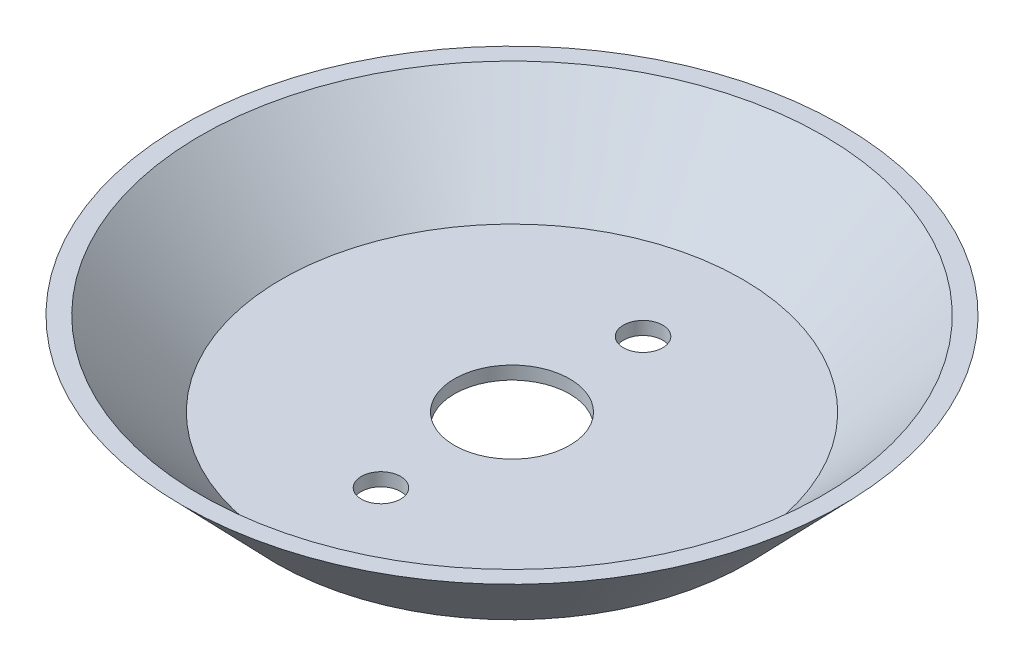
ISO-10303-21;
HEADER;
FILE_DESCRIPTION(('STEP AP214'),'2;1');
FILE_NAME('part.step','',(''),(''),'','','');
FILE_SCHEMA(('AUTOMOTIVE_DESIGN { 1 0 10303 214 1 1 1 1 }'));
ENDSEC;
DATA;
#1=APPLICATION_CONTEXT('core data for automotive mechanical design processes');
#2=APPLICATION_PROTOCOL_DEFINITION('international standard','automotive_design',2000,#1);
#3=PRODUCT_CONTEXT('',#1,'mechanical');
#4=PRODUCT('Part','Part','',(#3));
#5=PRODUCT_RELATED_PRODUCT_CATEGORY('part','',(#4));
#6=PRODUCT_DEFINITION_FORMATION('','',#4);
#7=PRODUCT_DEFINITION_CONTEXT('part definition',#1,'design');
#8=PRODUCT_DEFINITION('design','',#6,#7);
#9=PRODUCT_DEFINITION_SHAPE('','',#8);
#10=(LENGTH_UNIT() NAMED_UNIT(*) SI_UNIT(.MILLI.,.METRE.));
#11=(NAMED_UNIT(*) PLANE_ANGLE_UNIT() SI_UNIT($,.RADIAN.));
#12=(NAMED_UNIT(*) SI_UNIT($,.STERADIAN.) SOLID_ANGLE_UNIT());
#13=UNCERTAINTY_MEASURE_WITH_UNIT(LENGTH_MEASURE(1.E-05),#10,'distance_accuracy_value','');
#14=(GEOMETRIC_REPRESENTATION_CONTEXT(3) GLOBAL_UNCERTAINTY_ASSIGNED_CONTEXT((#13)) GLOBAL_UNIT_ASSIGNED_CONTEXT((#10,
#11,#12)) REPRESENTATION_CONTEXT('',''));
#15=CARTESIAN_POINT('',(0.,0.,0.));
#16=DIRECTION('',(0.,0.,1.));
#17=DIRECTION('',(1.,0.,0.));
#18=AXIS2_PLACEMENT_3D('',#15,#16,#17);
#19=CARTESIAN_POINT('',(-7.95774089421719,7.4,0.));
#20=DIRECTION('',(0.,-1.,0.));
#21=DIRECTION('',(0.,0.,-1.));
#22=AXIS2_PLACEMENT_3D('',#19,#20,#21);
#23=PLANE('',#22);
#24=CARTESIAN_POINT('',(0.,7.4,0.));
#25=DIRECTION('',(0.,1.,0.));
#26=DIRECTION('',(0.,0.,1.));
#27=AXIS2_PLACEMENT_3D('',#24,#25,#26);
#28=CIRCLE('',#27,25.15);
#29=CARTESIAN_POINT('',(0.,7.4,25.15));
#30=VERTEX_POINT('',#29);
#31=EDGE_CURVE('E31',#30,#30,#28,.T.);
#32=ORIENTED_EDGE('',*,*,#31,.T.);
#33=EDGE_LOOP('',(#32));
#34=FACE_BOUND('',#33,.T.);
#35=CARTESIAN_POINT('',(0.,7.4,0.));
#36=DIRECTION('',(0.,-1.,0.));
#37=DIRECTION('',(0.,0.,-1.));
#38=AXIS2_PLACEMENT_3D('',#35,#36,#37);
#39=CIRCLE('',#38,23.7594699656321);
#40=CARTESIAN_POINT('',(0.,7.4,-23.7594699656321));
#41=VERTEX_POINT('',#40);
#42=EDGE_CURVE('E39',#41,#41,#39,.F.);
#43=ORIENTED_EDGE('',*,*,#42,.F.);
#44=EDGE_LOOP('',(#43));
#45=FACE_BOUND('',#44,.T.);
#46=ADVANCED_FACE('F24',(#34,#45),#23,.F.);
#47=CARTESIAN_POINT('',(0.,0.,0.));
#48=DIRECTION('',(0.,1.,0.));
#49=DIRECTION('',(0.,0.,1.));
#50=AXIS2_PLACEMENT_3D('',#47,#48,#49);
#51=CONICAL_SURFACE('',#50,18.,0.768217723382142);
#52=ORIENTED_EDGE('',*,*,#31,.F.);
#53=EDGE_LOOP('',(#52));
#54=FACE_BOUND('',#53,.T.);
#55=CARTESIAN_POINT('',(0.,0.,0.));
#56=DIRECTION('',(0.,1.,0.));
#57=DIRECTION('',(0.,0.,1.));
#58=AXIS2_PLACEMENT_3D('',#55,#56,#57);
#59=CIRCLE('',#58,18.);
#60=CARTESIAN_POINT('',(0.,0.,18.));
#61=VERTEX_POINT('',#60);
#62=EDGE_CURVE('E10',#61,#61,#59,.T.);
#63=ORIENTED_EDGE('',*,*,#62,.T.);
#64=EDGE_LOOP('',(#63));
#65=FACE_BOUND('',#64,.T.);
#66=ADVANCED_FACE('F26',(#54,#65),#51,.T.);
#67=CARTESIAN_POINT('',(-7.95774089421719,0.,0.));
#68=DIRECTION('',(0.,-1.,0.));
#69=DIRECTION('',(0.,0.,-1.));
#70=AXIS2_PLACEMENT_3D('',#67,#68,#69);
#71=PLANE('',#70);
#72=CARTESIAN_POINT('',(0.,0.,10.));
#73=DIRECTION('',(0.,-1.,0.));
#74=DIRECTION('',(0.,0.,-1.));
#75=AXIS2_PLACEMENT_3D('',#72,#73,#74);
#76=CIRCLE('',#75,1.5);
#77=CARTESIAN_POINT('',(0.,0.,8.5));
#78=VERTEX_POINT('',#77);
#79=EDGE_CURVE('E56',#78,#78,#76,.T.);
#80=ORIENTED_EDGE('',*,*,#79,.F.);
#81=EDGE_LOOP('',(#80));
#82=FACE_BOUND('',#81,.T.);
#83=CARTESIAN_POINT('',(0.,0.,-10.));
#84=DIRECTION('',(0.,-1.,0.));
#85=DIRECTION('',(0.,0.,-1.));
#86=AXIS2_PLACEMENT_3D('',#83,#84,#85);
#87=CIRCLE('',#86,1.5);
#88=CARTESIAN_POINT('',(0.,0.,-11.5));
#89=VERTEX_POINT('',#88);
#90=EDGE_CURVE('E50',#89,#89,#87,.T.);
#91=ORIENTED_EDGE('',*,*,#90,.F.);
#92=EDGE_LOOP('',(#91));
#93=FACE_BOUND('',#92,.T.);
#94=CARTESIAN_POINT('',(0.,0.,0.));
#95=DIRECTION('',(0.,-1.,0.));
#96=DIRECTION('',(0.,0.,-1.));
#97=AXIS2_PLACEMENT_3D('',#94,#95,#96);
#98=CIRCLE('',#97,4.4);
#99=CARTESIAN_POINT('',(0.,0.,-4.4));
#100=VERTEX_POINT('',#99);
#101=EDGE_CURVE('E43',#100,#100,#98,.T.);
#102=ORIENTED_EDGE('',*,*,#101,.F.);
#103=EDGE_LOOP('',(#102));
#104=FACE_BOUND('',#103,.T.);
#105=ORIENTED_EDGE('',*,*,#62,.F.);
#106=EDGE_LOOP('',(#105));
#107=FACE_BOUND('',#106,.T.);
#108=ADVANCED_FACE('F78',(#82,#93,#104,#107),#71,.T.);
#109=CARTESIAN_POINT('',(0.,0.694854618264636,0.));
#110=DIRECTION('',(0.,1.,0.));
#111=DIRECTION('',(0.,0.,1.));
#112=AXIS2_PLACEMENT_3D('',#109,#110,#111);
#113=CONICAL_SURFACE('',#112,17.2808497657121,0.768217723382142);
#114=ORIENTED_EDGE('',*,*,#42,.T.);
#115=EDGE_LOOP('',(#114));
#116=FACE_BOUND('',#115,.T.);
#117=CARTESIAN_POINT('',(0.,1.,0.));
#118=DIRECTION('',(0.,-1.,0.));
#119=DIRECTION('',(0.,0.,-1.));
#120=AXIS2_PLACEMENT_3D('',#117,#118,#119);
#121=CIRCLE('',#120,17.5756861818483);
#122=CARTESIAN_POINT('',(0.,1.,-17.5756861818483));
#123=VERTEX_POINT('',#122);
#124=EDGE_CURVE('E35',#123,#123,#121,.F.);
#125=ORIENTED_EDGE('',*,*,#124,.F.);
#126=EDGE_LOOP('',(#125));
#127=FACE_BOUND('',#126,.T.);
#128=ADVANCED_FACE('F69',(#116,#127),#113,.F.);
#129=CARTESIAN_POINT('',(-7.95774089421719,1.,0.));
#130=DIRECTION('',(0.,-1.,0.));
#131=DIRECTION('',(0.,0.,-1.));
#132=AXIS2_PLACEMENT_3D('',#129,#130,#131);
#133=PLANE('',#132);
#134=CARTESIAN_POINT('',(0.,1.,10.));
#135=DIRECTION('',(0.,1.,0.));
#136=DIRECTION('',(0.,0.,-1.));
#137=AXIS2_PLACEMENT_3D('',#134,#135,#136);
#138=CIRCLE('',#137,1.5);
#139=CARTESIAN_POINT('',(0.,1.,8.5));
#140=VERTEX_POINT('',#139);
#141=EDGE_CURVE('E59',#140,#140,#138,.T.);
#142=ORIENTED_EDGE('',*,*,#141,.F.);
#143=EDGE_LOOP('',(#142));
#144=FACE_BOUND('',#143,.T.);
#145=CARTESIAN_POINT('',(0.,1.,-10.));
#146=DIRECTION('',(0.,1.,0.));
#147=DIRECTION('',(0.,0.,1.));
#148=AXIS2_PLACEMENT_3D('',#145,#146,#147);
#149=CIRCLE('',#148,1.5);
#150=CARTESIAN_POINT('',(0.,1.,-8.5));
#151=VERTEX_POINT('',#150);
#152=EDGE_CURVE('E53',#151,#151,#149,.T.);
#153=ORIENTED_EDGE('',*,*,#152,.F.);
#154=EDGE_LOOP('',(#153));
#155=FACE_BOUND('',#154,.T.);
#156=CARTESIAN_POINT('',(0.,1.,0.));
#157=DIRECTION('',(0.,1.,0.));
#158=DIRECTION('',(0.,0.,1.));
#159=AXIS2_PLACEMENT_3D('',#156,#157,#158);
#160=CIRCLE('',#159,4.4);
#161=CARTESIAN_POINT('',(0.,1.,4.4));
#162=VERTEX_POINT('',#161);
#163=EDGE_CURVE('E47',#162,#162,#160,.T.);
#164=ORIENTED_EDGE('',*,*,#163,.F.);
#165=EDGE_LOOP('',(#164));
#166=FACE_BOUND('',#165,.T.);
#167=ORIENTED_EDGE('',*,*,#124,.T.);
#168=EDGE_LOOP('',(#167));
#169=FACE_BOUND('',#168,.T.);
#170=ADVANCED_FACE('F65',(#144,#155,#166,#169),#133,.F.);
#171=CARTESIAN_POINT('',(0.,-6.14,0.));
#172=DIRECTION('',(0.,1.,0.));
#173=DIRECTION('',(0.,0.,1.));
#174=AXIS2_PLACEMENT_3D('',#171,#172,#173);
#175=CYLINDRICAL_SURFACE('',#174,4.4);
#176=ORIENTED_EDGE('',*,*,#101,.T.);
#177=EDGE_LOOP('',(#176));
#178=FACE_BOUND('',#177,.T.);
#179=ORIENTED_EDGE('',*,*,#163,.T.);
#180=EDGE_LOOP('',(#179));
#181=FACE_BOUND('',#180,.T.);
#182=ADVANCED_FACE('F68',(#178,#181),#175,.F.);
#183=CARTESIAN_POINT('',(0.,-9.,-10.));
#184=DIRECTION('',(0.,1.,0.));
#185=DIRECTION('',(0.,0.,1.));
#186=AXIS2_PLACEMENT_3D('',#183,#184,#185);
#187=CYLINDRICAL_SURFACE('',#186,1.5);
#188=ORIENTED_EDGE('',*,*,#90,.T.);
#189=EDGE_LOOP('',(#188));
#190=FACE_BOUND('',#189,.T.);
#191=ORIENTED_EDGE('',*,*,#152,.T.);
#192=EDGE_LOOP('',(#191));
#193=FACE_BOUND('',#192,.T.);
#194=ADVANCED_FACE('F116',(#190,#193),#187,.F.);
#195=CARTESIAN_POINT('',(0.,-9.,10.));
#196=DIRECTION('',(0.,1.,0.));
#197=DIRECTION('',(0.,0.,1.));
#198=AXIS2_PLACEMENT_3D('',#195,#196,#197);
#199=CYLINDRICAL_SURFACE('',#198,1.5);
#200=ORIENTED_EDGE('',*,*,#79,.T.);
#201=EDGE_LOOP('',(#200));
#202=FACE_BOUND('',#201,.T.);
#203=ORIENTED_EDGE('',*,*,#141,.T.);
#204=EDGE_LOOP('',(#203));
#205=FACE_BOUND('',#204,.T.);
#206=ADVANCED_FACE('F63',(#202,#205),#199,.F.);
#207=CLOSED_SHELL('',(#46,#66,#108,#128,#170,#182,#194,#206));
#208=MANIFOLD_SOLID_BREP('B2',#207);
#209=ADVANCED_BREP_SHAPE_REPRESENTATION('',(#18,#208),#14);
#210=SHAPE_DEFINITION_REPRESENTATION(#9,#209);
ENDSEC;
END-ISO-10303-21;
